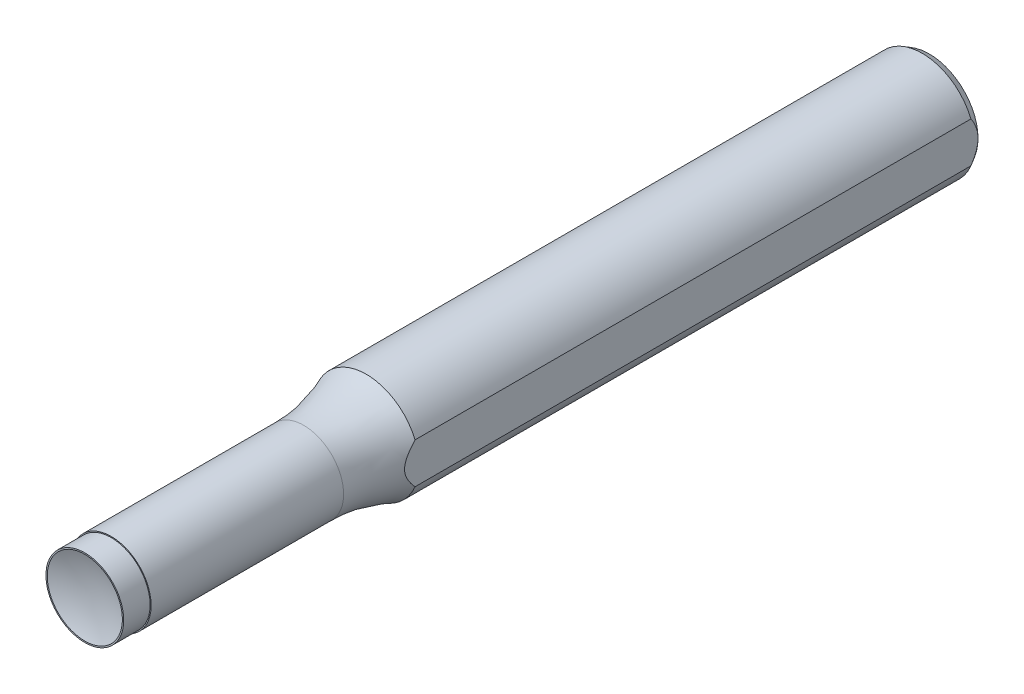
ISO-10303-21;
HEADER;
FILE_DESCRIPTION(('STEP AP214'),'2;1');
FILE_NAME('part.step','',(''),(''),'','','');
FILE_SCHEMA(('AUTOMOTIVE_DESIGN { 1 0 10303 214 1 1 1 1 }'));
ENDSEC;
DATA;
#1=APPLICATION_CONTEXT('core data for automotive mechanical design processes');
#2=APPLICATION_PROTOCOL_DEFINITION('international standard','automotive_design',2000,#1);
#3=PRODUCT_CONTEXT('',#1,'mechanical');
#4=PRODUCT('Part','Part','',(#3));
#5=PRODUCT_RELATED_PRODUCT_CATEGORY('part','',(#4));
#6=PRODUCT_DEFINITION_FORMATION('','',#4);
#7=PRODUCT_DEFINITION_CONTEXT('part definition',#1,'design');
#8=PRODUCT_DEFINITION('design','',#6,#7);
#9=PRODUCT_DEFINITION_SHAPE('','',#8);
#10=(LENGTH_UNIT() NAMED_UNIT(*) SI_UNIT(.MILLI.,.METRE.));
#11=(NAMED_UNIT(*) PLANE_ANGLE_UNIT() SI_UNIT($,.RADIAN.));
#12=(NAMED_UNIT(*) SI_UNIT($,.STERADIAN.) SOLID_ANGLE_UNIT());
#13=UNCERTAINTY_MEASURE_WITH_UNIT(LENGTH_MEASURE(1.E-05),#10,'distance_accuracy_value','');
#14=(GEOMETRIC_REPRESENTATION_CONTEXT(3) GLOBAL_UNCERTAINTY_ASSIGNED_CONTEXT((#13)) GLOBAL_UNIT_ASSIGNED_CONTEXT((#10,
#11,#12)) REPRESENTATION_CONTEXT('',''));
#15=CARTESIAN_POINT('',(0.,0.,0.));
#16=DIRECTION('',(0.,0.,1.));
#17=DIRECTION('',(1.,0.,0.));
#18=AXIS2_PLACEMENT_3D('',#15,#16,#17);
#19=CARTESIAN_POINT('',(0.,0.,-42.3333333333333));
#20=DIRECTION('',(0.,0.,1.));
#21=DIRECTION('',(1.,0.,0.));
#22=AXIS2_PLACEMENT_3D('',#19,#20,#21);
#23=CYLINDRICAL_SURFACE('',#22,6.);
#24=CARTESIAN_POINT('',(0.,0.,-32.9174956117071));
#25=DIRECTION('',(0.,0.,1.));
#26=DIRECTION('',(0.,-1.,0.));
#27=AXIS2_PLACEMENT_3D('',#24,#25,#26);
#28=CIRCLE('',#27,6.);
#29=CARTESIAN_POINT('',(0.,-6.,-32.9174956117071));
#30=VERTEX_POINT('',#29);
#31=EDGE_CURVE('E79',#30,#30,#28,.F.);
#32=ORIENTED_EDGE('',*,*,#31,.F.);
#33=EDGE_LOOP('',(#32));
#34=FACE_BOUND('',#33,.T.);
#35=CARTESIAN_POINT('',(0.,0.,-3.97));
#36=DIRECTION('',(0.,0.,1.));
#37=DIRECTION('',(1.,0.,0.));
#38=AXIS2_PLACEMENT_3D('',#35,#36,#37);
#39=CIRCLE('',#38,6.);
#40=CARTESIAN_POINT('',(6.,0.,-3.97));
#41=VERTEX_POINT('',#40);
#42=EDGE_CURVE('E90',#41,#41,#39,.F.);
#43=ORIENTED_EDGE('',*,*,#42,.T.);
#44=EDGE_LOOP('',(#43));
#45=FACE_BOUND('',#44,.T.);
#46=ADVANCED_FACE('F42',(#34,#45),#23,.T.);
#47=CARTESIAN_POINT('',(0.,0.,-3.97));
#48=DIRECTION('',(0.,0.,1.));
#49=DIRECTION('',(1.,0.,0.));
#50=AXIS2_PLACEMENT_3D('',#47,#48,#49);
#51=PLANE('',#50);
#52=ORIENTED_EDGE('',*,*,#42,.F.);
#53=EDGE_LOOP('',(#52));
#54=FACE_BOUND('',#53,.T.);
#55=CARTESIAN_POINT('',(0.,0.,-3.97));
#56=DIRECTION('',(0.,0.,1.));
#57=DIRECTION('',(1.,0.,0.));
#58=AXIS2_PLACEMENT_3D('',#55,#56,#57);
#59=CIRCLE('',#58,5.85);
#60=CARTESIAN_POINT('',(5.85,0.,-3.97));
#61=VERTEX_POINT('',#60);
#62=EDGE_CURVE('E97',#61,#61,#59,.T.);
#63=ORIENTED_EDGE('',*,*,#62,.F.);
#64=EDGE_LOOP('',(#63));
#65=FACE_BOUND('',#64,.T.);
#66=ADVANCED_FACE('F109',(#54,#65),#51,.T.);
#67=CARTESIAN_POINT('',(0.,0.,-3.97));
#68=DIRECTION('',(0.,0.,1.));
#69=DIRECTION('',(1.,0.,0.));
#70=AXIS2_PLACEMENT_3D('',#67,#68,#69);
#71=CYLINDRICAL_SURFACE('',#70,5.85);
#72=ORIENTED_EDGE('',*,*,#62,.T.);
#73=EDGE_LOOP('',(#72));
#74=FACE_BOUND('',#73,.T.);
#75=CARTESIAN_POINT('',(0.,0.,0.));
#76=DIRECTION('',(0.,0.,1.));
#77=DIRECTION('',(1.,0.,0.));
#78=AXIS2_PLACEMENT_3D('',#75,#76,#77);
#79=CIRCLE('',#78,5.85);
#80=CARTESIAN_POINT('',(5.85,0.,0.));
#81=VERTEX_POINT('',#80);
#82=EDGE_CURVE('E120',#81,#81,#79,.T.);
#83=ORIENTED_EDGE('',*,*,#82,.F.);
#84=EDGE_LOOP('',(#83));
#85=FACE_BOUND('',#84,.T.);
#86=ADVANCED_FACE('F115',(#74,#85),#71,.T.);
#87=CARTESIAN_POINT('',(0.,0.,0.));
#88=DIRECTION('',(0.,0.,1.));
#89=DIRECTION('',(1.,0.,0.));
#90=AXIS2_PLACEMENT_3D('',#87,#88,#89);
#91=PLANE('',#90);
#92=CARTESIAN_POINT('',(0.,0.,0.));
#93=DIRECTION('',(0.,0.,1.));
#94=DIRECTION('',(0.,-1.,0.));
#95=AXIS2_PLACEMENT_3D('',#92,#93,#94);
#96=CIRCLE('',#95,5.65);
#97=CARTESIAN_POINT('',(0.,-5.65,0.));
#98=VERTEX_POINT('',#97);
#99=EDGE_CURVE('E125',#98,#98,#96,.T.);
#100=ORIENTED_EDGE('',*,*,#99,.F.);
#101=EDGE_LOOP('',(#100));
#102=FACE_BOUND('',#101,.T.);
#103=ORIENTED_EDGE('',*,*,#82,.T.);
#104=EDGE_LOOP('',(#103));
#105=FACE_BOUND('',#104,.T.);
#106=ADVANCED_FACE('F156',(#102,#105),#91,.T.);
#107=CARTESIAN_POINT('',(0.,0.,14.8408860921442));
#108=DIRECTION('',(0.,0.,1.));
#109=DIRECTION('',(0.,-1.,0.));
#110=AXIS2_PLACEMENT_3D('',#107,#108,#109);
#111=SPHERICAL_SURFACE('',#110,15.88);
#112=ORIENTED_EDGE('',*,*,#99,.T.);
#113=EDGE_LOOP('',(#112));
#114=FACE_BOUND('',#113,.T.);
#115=ADVANCED_FACE('F159',(#114),#111,.F.);
#116=CARTESIAN_POINT('',(0.,0.,-32.9174956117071));
#117=DIRECTION('',(0.,0.,-1.));
#118=DIRECTION('',(0.,1.,0.));
#119=AXIS2_PLACEMENT_3D('',#116,#117,#118);
#120=TOROIDAL_SURFACE('',#119,29.82,23.82);
#121=CARTESIAN_POINT('',(7.32877851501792,14.2795877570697,-52.3543799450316));
#122=CARTESIAN_POINT('',(7.32877851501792,14.0393982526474,-52.203000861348));
#123=CARTESIAN_POINT('',(7.32877851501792,13.8012540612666,-52.0484082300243));
#124=CARTESIAN_POINT('',(7.32877851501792,13.3290852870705,-51.7330837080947));
#125=CARTESIAN_POINT('',(7.32877851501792,13.0950604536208,-51.5723521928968));
#126=CARTESIAN_POINT('',(7.32877851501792,12.3994624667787,-51.0815626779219));
#127=CARTESIAN_POINT('',(7.32877851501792,11.9440576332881,-50.7427147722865));
#128=CARTESIAN_POINT('',(7.32877851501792,11.0529688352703,-50.0467778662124));
#129=CARTESIAN_POINT('',(7.32877851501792,10.6171627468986,-49.6898444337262));
#130=CARTESIAN_POINT('',(7.32877851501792,9.76079496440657,-48.9580849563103));
#131=CARTESIAN_POINT('',(7.32877851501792,9.34023511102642,-48.5832567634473));
#132=CARTESIAN_POINT('',(7.32877851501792,8.51690474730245,-47.8225416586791));
#133=CARTESIAN_POINT('',(7.32877851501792,8.11400033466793,-47.4367990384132));
#134=CARTESIAN_POINT('',(7.32877851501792,7.51777550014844,-46.8499808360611));
#135=CARTESIAN_POINT('',(7.32877851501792,7.32038661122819,-46.6530047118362));
#136=CARTESIAN_POINT('',(7.32877851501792,6.9278267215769,-46.256853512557));
#137=CARTESIAN_POINT('',(7.32877851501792,6.73265572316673,-46.0576784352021));
#138=CARTESIAN_POINT('',(7.32877851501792,6.34374892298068,-45.6575555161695));
#139=CARTESIAN_POINT('',(7.32877851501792,6.15001472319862,-45.4566061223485));
#140=CARTESIAN_POINT('',(7.32877851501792,5.76339986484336,-45.0538895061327));
#141=CARTESIAN_POINT('',(7.32877851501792,5.57051920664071,-44.8521222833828));
#142=CARTESIAN_POINT('',(7.32877851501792,5.18461104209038,-44.4487600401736));
#143=CARTESIAN_POINT('',(7.32877851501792,4.99158354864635,-44.2471650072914));
#144=CARTESIAN_POINT('',(7.32877851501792,4.60401918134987,-43.8454334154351));
#145=CARTESIAN_POINT('',(7.32877851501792,4.40948236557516,-43.645296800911));
#146=CARTESIAN_POINT('',(7.32877851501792,4.14723954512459,-43.3800829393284));
#147=CARTESIAN_POINT('',(7.32877851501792,4.08104059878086,-43.3135182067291));
#148=CARTESIAN_POINT('',(7.32877851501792,3.94816187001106,-43.1808699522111));
#149=CARTESIAN_POINT('',(7.32877851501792,3.88148208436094,-43.114786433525));
#150=CARTESIAN_POINT('',(7.32877851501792,3.68058491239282,-42.9174220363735));
#151=CARTESIAN_POINT('',(7.32877851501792,3.54550041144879,-42.7870178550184));
#152=CARTESIAN_POINT('',(7.32877851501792,3.2717754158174,-42.5294069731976));
#153=CARTESIAN_POINT('',(7.32877851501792,3.13312816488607,-42.4022074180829));
#154=CARTESIAN_POINT('',(7.32877851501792,2.85130496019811,-42.1529095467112));
#155=CARTESIAN_POINT('',(7.32877851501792,2.7081296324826,-42.0308105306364));
#156=CARTESIAN_POINT('',(7.32877851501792,2.4543267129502,-41.825456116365));
#157=CARTESIAN_POINT('',(7.32877851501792,2.34510762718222,-41.7404691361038));
#158=CARTESIAN_POINT('',(7.32877851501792,2.1226083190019,-41.5760100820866));
#159=CARTESIAN_POINT('',(7.32877851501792,2.00932933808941,-41.4965363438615));
#160=CARTESIAN_POINT('',(7.32877851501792,1.77819762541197,-41.3452373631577));
#161=CARTESIAN_POINT('',(7.32877851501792,1.66035964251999,-41.2733898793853));
#162=CARTESIAN_POINT('',(7.32877851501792,1.41914925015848,-41.1397858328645));
#163=CARTESIAN_POINT('',(7.32877851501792,1.29578165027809,-41.0780207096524));
#164=CARTESIAN_POINT('',(7.32877851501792,1.02294248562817,-40.9592230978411));
#165=CARTESIAN_POINT('',(7.32877851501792,0.872434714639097,-40.9044961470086));
#166=CARTESIAN_POINT('',(7.32877851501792,0.56452978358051,-40.8196795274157));
#167=CARTESIAN_POINT('',(7.32877851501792,0.407145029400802,-40.7895472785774));
#168=CARTESIAN_POINT('',(7.32877851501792,0.168337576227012,-40.7663484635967));
#169=CARTESIAN_POINT('',(7.32877851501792,0.0878974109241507,-40.7623156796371));
#170=CARTESIAN_POINT('',(7.32877851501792,-0.0730050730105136,-40.7618471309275));
#171=CARTESIAN_POINT('',(7.32877851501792,-0.153467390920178,-40.7654111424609));
#172=CARTESIAN_POINT('',(7.32877851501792,-0.393758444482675,-40.7873691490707));
#173=CARTESIAN_POINT('',(7.32877851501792,-0.552631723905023,-40.8170158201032));
#174=CARTESIAN_POINT('',(7.32877851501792,-0.910509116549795,-40.9142233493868));
#175=CARTESIAN_POINT('',(7.32877851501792,-1.10702898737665,-40.9905708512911));
#176=CARTESIAN_POINT('',(7.32877851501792,-1.3915062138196,-41.1263804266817));
#177=CARTESIAN_POINT('',(7.32877851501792,-1.48486398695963,-41.1753672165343));
#178=CARTESIAN_POINT('',(7.32877851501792,-1.6683508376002,-41.2790446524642));
#179=CARTESIAN_POINT('',(7.32877851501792,-1.75848081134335,-41.3337336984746));
#180=CARTESIAN_POINT('',(7.32877851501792,-1.99971641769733,-41.4886159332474));
#181=CARTESIAN_POINT('',(7.32877851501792,-2.1479749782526,-41.5932086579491));
#182=CARTESIAN_POINT('',(7.32877851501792,-2.43781275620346,-41.8113372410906));
#183=CARTESIAN_POINT('',(7.32877851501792,-2.57938647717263,-41.9248802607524));
#184=CARTESIAN_POINT('',(7.32877851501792,-2.85777730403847,-42.1583629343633));
#185=CARTESIAN_POINT('',(7.32877851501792,-2.99458030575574,-42.278319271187));
#186=CARTESIAN_POINT('',(7.32877851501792,-3.26430845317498,-42.5223996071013));
#187=CARTESIAN_POINT('',(7.32877851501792,-3.39723479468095,-42.6465222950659));
#188=CARTESIAN_POINT('',(7.32877851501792,-3.66164073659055,-42.8989451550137));
#189=CARTESIAN_POINT('',(7.32877851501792,-3.79309190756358,-43.0272749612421));
#190=CARTESIAN_POINT('',(7.32877851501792,-4.05400852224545,-43.2859453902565));
#191=CARTESIAN_POINT('',(7.32877851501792,-4.18347384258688,-43.4162861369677));
#192=CARTESIAN_POINT('',(7.32877851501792,-4.44088800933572,-43.6780719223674));
#193=CARTESIAN_POINT('',(7.32877851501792,-4.56883882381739,-43.809515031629));
#194=CARTESIAN_POINT('',(7.32877851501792,-4.82394795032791,-44.0731620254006));
#195=CARTESIAN_POINT('',(7.32877851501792,-4.95110627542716,-44.205365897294));
#196=CARTESIAN_POINT('',(7.32877851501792,-5.25569316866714,-44.5228914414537));
#197=CARTESIAN_POINT('',(7.32877851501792,-5.43295145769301,-44.7083761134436));
#198=CARTESIAN_POINT('',(7.32877851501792,-5.78770408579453,-45.0791206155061));
#199=CARTESIAN_POINT('',(7.32877851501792,-5.96519842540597,-45.2643804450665));
#200=CARTESIAN_POINT('',(7.32877851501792,-6.32113567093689,-45.633988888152));
#201=CARTESIAN_POINT('',(7.32877851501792,-6.49957857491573,-45.8183375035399));
#202=CARTESIAN_POINT('',(7.32877851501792,-6.85796743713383,-46.1855669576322));
#203=CARTESIAN_POINT('',(7.32877851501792,-7.03791339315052,-46.3684477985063));
#204=CARTESIAN_POINT('',(7.32877851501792,-7.58055333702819,-46.9140266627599));
#205=CARTESIAN_POINT('',(7.32877851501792,-7.94619559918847,-47.2738144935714));
#206=CARTESIAN_POINT('',(7.32877851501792,-8.68790577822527,-47.9825415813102));
#207=CARTESIAN_POINT('',(7.32877851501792,-9.06397393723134,-48.3314805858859));
#208=CARTESIAN_POINT('',(7.32877851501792,-9.82269119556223,-49.0111363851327));
#209=CARTESIAN_POINT('',(7.32877851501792,-10.2051709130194,-49.3420416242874));
#210=CARTESIAN_POINT('',(7.32877851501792,-10.982677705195,-49.988722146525));
#211=CARTESIAN_POINT('',(7.32877851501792,-11.3777035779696,-50.3044988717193));
#212=CARTESIAN_POINT('',(7.32877851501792,-12.182703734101,-50.9205051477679));
#213=CARTESIAN_POINT('',(7.32877851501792,-12.5927396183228,-51.220654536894));
#214=CARTESIAN_POINT('',(7.32877851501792,-13.2177751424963,-51.6567016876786));
#215=CARTESIAN_POINT('',(7.32877851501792,-13.4278332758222,-51.7997191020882));
#216=CARTESIAN_POINT('',(7.32877851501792,-13.8512445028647,-52.0808093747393));
#217=CARTESIAN_POINT('',(7.32877851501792,-14.0645977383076,-52.2188820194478));
#218=CARTESIAN_POINT('',(7.32877851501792,-14.2795877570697,-52.3543799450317));
#219=B_SPLINE_CURVE_WITH_KNOTS('',3,(#121,#122,#123,#124,#125,#126,#127,#128,#129,#130,#131,
#132,#133,#134,#135,#136,#137,#138,#139,#140,#141,#142,#143,#144,#145,#146,#147,#148,#149,#150,
#151,#152,#153,#154,#155,#156,#157,#158,#159,#160,#161,#162,#163,#164,#165,#166,#167,#168,#169,
#170,#171,#172,#173,#174,#175,#176,#177,#178,#179,#180,#181,#182,#183,#184,#185,#186,#187,#188,
#189,#190,#191,#192,#193,#194,#195,#196,#197,#198,#199,#200,#201,#202,#203,#204,#205,#206,#207,
#208,#209,#210,#211,#212,#213,#214,#215,#216,#217,#218),.UNSPECIFIED.,.F.,.F.,(4,2,2,2,2,2,2,2,
2,2,2,2,2,2,2,2,2,2,2,2,2,2,2,2,2,2,2,2,2,2,2,2,2,2,2,2,2,2,2,2,2,2,2,2,2,2,2,2,4),(0.,
0.851683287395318,1.70331457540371,3.40548445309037,5.09490998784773,6.7845388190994,
8.45761684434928,9.29417814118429,10.1307403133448,10.9681260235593,11.805512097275,
12.6428315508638,13.4801189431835,13.7617519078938,14.04338676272,14.6066166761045,
15.1710076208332,15.7353208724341,16.1503628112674,16.5652788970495,16.9789495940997,
17.3922672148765,17.8711591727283,18.3492202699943,18.5905181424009,18.8318089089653,
19.3139742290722,19.9427313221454,20.2589021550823,20.5749845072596,21.1187662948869,
21.6629876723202,22.2087010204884,22.7542442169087,23.3053313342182,23.8564525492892,
24.4067545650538,24.9570474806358,25.7267391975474,26.4964326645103,27.2661245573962,
28.0358153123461,29.5745610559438,31.1133425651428,32.630264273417,34.147041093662,
35.6709561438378,36.4332635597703,37.1956038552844),.UNSPECIFIED.);
#220=CARTESIAN_POINT('',(7.32877851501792,3.05493133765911,-42.3333333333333));
#221=VERTEX_POINT('',#220);
#222=CARTESIAN_POINT('',(7.32877851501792,-3.05493133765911,-42.3333333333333));
#223=VERTEX_POINT('',#222);
#224=EDGE_CURVE('E58',#221,#223,#219,.T.);
#225=ORIENTED_EDGE('',*,*,#224,.F.);
#226=CARTESIAN_POINT('',(0.,0.,-42.3333333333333));
#227=DIRECTION('',(0.,0.,-1.));
#228=DIRECTION('',(0.,1.,0.));
#229=AXIS2_PLACEMENT_3D('',#226,#227,#228);
#230=CIRCLE('',#229,7.94);
#231=EDGE_CURVE('E129',#223,#221,#230,.T.);
#232=ORIENTED_EDGE('',*,*,#231,.F.);
#233=EDGE_LOOP('',(#225,#232));
#234=FACE_BOUND('',#233,.T.);
#235=ORIENTED_EDGE('',*,*,#31,.T.);
#236=EDGE_LOOP('',(#235));
#237=FACE_BOUND('',#236,.T.);
#238=ADVANCED_FACE('F105',(#234,#237),#120,.F.);
#239=CARTESIAN_POINT('',(0.,0.,-127.));
#240=DIRECTION('',(0.,0.,1.));
#241=DIRECTION('',(1.,0.,0.));
#242=AXIS2_PLACEMENT_3D('',#239,#240,#241);
#243=PLANE('',#242);
#244=CARTESIAN_POINT('',(0.,0.,-127.));
#245=DIRECTION('',(0.,0.,1.));
#246=DIRECTION('',(1.,0.,0.));
#247=AXIS2_PLACEMENT_3D('',#244,#245,#246);
#248=CIRCLE('',#247,7.32877851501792);
#249=CARTESIAN_POINT('',(7.32877851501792,0.,-127.));
#250=VERTEX_POINT('',#249);
#251=EDGE_CURVE('E85',#250,#250,#248,.F.);
#252=ORIENTED_EDGE('',*,*,#251,.T.);
#253=EDGE_LOOP('',(#252));
#254=FACE_BOUND('',#253,.T.);
#255=ADVANCED_FACE('F154',(#254),#243,.F.);
#256=CARTESIAN_POINT('',(0.,0.,-125.941333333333));
#257=DIRECTION('',(0.,0.,1.));
#258=DIRECTION('',(1.,0.,0.));
#259=AXIS2_PLACEMENT_3D('',#256,#257,#258);
#260=CONICAL_SURFACE('',#259,7.94,0.523598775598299);
#261=CARTESIAN_POINT('',(7.32877851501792,-8.88843113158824,-119.740230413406));
#262=CARTESIAN_POINT('',(7.32877851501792,-8.73080406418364,-119.950851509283));
#263=CARTESIAN_POINT('',(7.32877851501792,-8.57211012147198,-120.160681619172));
#264=CARTESIAN_POINT('',(7.32877851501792,-8.2522191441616,-120.578457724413));
#265=CARTESIAN_POINT('',(7.32877851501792,-8.09102185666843,-120.786403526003));
#266=CARTESIAN_POINT('',(7.32877851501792,-7.76533800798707,-121.200636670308));
#267=CARTESIAN_POINT('',(7.32877851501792,-7.60084359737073,-121.406917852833));
#268=CARTESIAN_POINT('',(7.32877851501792,-7.26855482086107,-121.816797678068));
#269=CARTESIAN_POINT('',(7.32877851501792,-7.10076056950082,-122.020396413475));
#270=CARTESIAN_POINT('',(7.32877851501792,-6.75953587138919,-122.426496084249));
#271=CARTESIAN_POINT('',(7.32877851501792,-6.5860646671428,-122.628962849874));
#272=CARTESIAN_POINT('',(7.32877851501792,-6.2345106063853,-123.029849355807));
#273=CARTESIAN_POINT('',(7.32877851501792,-6.05642794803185,-123.228269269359));
#274=CARTESIAN_POINT('',(7.32877851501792,-5.69497835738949,-123.619871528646));
#275=CARTESIAN_POINT('',(7.32877851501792,-5.51161708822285,-123.813059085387));
#276=CARTESIAN_POINT('',(7.32877851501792,-5.13840554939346,-124.193037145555));
#277=CARTESIAN_POINT('',(7.32877851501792,-4.94855643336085,-124.379828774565));
#278=CARTESIAN_POINT('',(7.32877851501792,-4.6185619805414,-124.690909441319));
#279=CARTESIAN_POINT('',(7.32877851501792,-4.48039232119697,-124.817291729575));
#280=CARTESIAN_POINT('',(7.32877851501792,-4.19962787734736,-125.065084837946));
#281=CARTESIAN_POINT('',(7.32877851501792,-4.05703278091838,-125.186495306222));
#282=CARTESIAN_POINT('',(7.32877851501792,-3.76656482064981,-125.423404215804));
#283=CARTESIAN_POINT('',(7.32877851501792,-3.6186830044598,-125.538891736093));
#284=CARTESIAN_POINT('',(7.32877851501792,-3.31722208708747,-125.762227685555));
#285=CARTESIAN_POINT('',(7.32877851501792,-3.16364295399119,-125.870076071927));
#286=CARTESIAN_POINT('',(7.32877851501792,-2.8476171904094,-126.077847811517));
#287=CARTESIAN_POINT('',(7.32877851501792,-2.68506781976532,-126.177616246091));
#288=CARTESIAN_POINT('',(7.32877851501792,-2.3528177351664,-126.364667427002));
#289=CARTESIAN_POINT('',(7.32877851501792,-2.18311574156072,-126.451947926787));
#290=CARTESIAN_POINT('',(7.32877851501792,-1.83724775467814,-126.610376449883));
#291=CARTESIAN_POINT('',(7.32877851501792,-1.66111710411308,-126.681600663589));
#292=CARTESIAN_POINT('',(7.32877851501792,-1.3022419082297,-126.804750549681));
#293=CARTESIAN_POINT('',(7.32877851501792,-1.11950321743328,-126.856692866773));
#294=CARTESIAN_POINT('',(7.32877851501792,-0.813030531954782,-126.923831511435));
#295=CARTESIAN_POINT('',(7.32877851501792,-0.690702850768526,-126.945522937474));
#296=CARTESIAN_POINT('',(7.32877851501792,-0.444657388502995,-126.978429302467));
#297=CARTESIAN_POINT('',(7.32877851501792,-0.320940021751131,-126.989647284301));
#298=CARTESIAN_POINT('',(7.32877851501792,-0.073012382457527,-127.001184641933));
#299=CARTESIAN_POINT('',(7.32877851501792,0.0511978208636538,-127.001505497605));
#300=CARTESIAN_POINT('',(7.32877851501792,0.299168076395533,-126.991242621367));
#301=CARTESIAN_POINT('',(7.32877851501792,0.422928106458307,-126.980658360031));
#302=CARTESIAN_POINT('',(7.32877851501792,0.668575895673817,-126.949047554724));
#303=CARTESIAN_POINT('',(7.32877851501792,0.790469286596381,-126.928064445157));
#304=CARTESIAN_POINT('',(7.32877851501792,1.03220206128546,-126.876404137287));
#305=CARTESIAN_POINT('',(7.32877851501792,1.15204057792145,-126.845722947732));
#306=CARTESIAN_POINT('',(7.32877851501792,1.50769171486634,-126.740480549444));
#307=CARTESIAN_POINT('',(7.32877851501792,1.73965666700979,-126.652718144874));
#308=CARTESIAN_POINT('',(7.32877851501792,2.17012243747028,-126.45964290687));
#309=CARTESIAN_POINT('',(7.32877851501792,2.36973261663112,-126.356709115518));
#310=CARTESIAN_POINT('',(7.32877851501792,2.75934848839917,-126.133817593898));
#311=CARTESIAN_POINT('',(7.32877851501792,2.9493454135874,-126.0138446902));
#312=CARTESIAN_POINT('',(7.32877851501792,3.32222206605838,-125.759850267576));
#313=CARTESIAN_POINT('',(7.32877851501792,3.50501774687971,-125.625706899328));
#314=CARTESIAN_POINT('',(7.32877851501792,3.86268505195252,-125.347474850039));
#315=CARTESIAN_POINT('',(7.32877851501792,4.03755997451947,-125.203390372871));
#316=CARTESIAN_POINT('',(7.32877851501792,4.43901655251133,-124.857102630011));
#317=CARTESIAN_POINT('',(7.32877851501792,4.66292739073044,-124.65181624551));
#318=CARTESIAN_POINT('',(7.32877851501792,5.10105623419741,-124.231095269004));
#319=CARTESIAN_POINT('',(7.32877851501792,5.31527068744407,-124.015657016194));
#320=CARTESIAN_POINT('',(7.32877851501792,5.73618445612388,-123.576758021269));
#321=CARTESIAN_POINT('',(7.32877851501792,5.94286768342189,-123.353281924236));
#322=CARTESIAN_POINT('',(7.32877851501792,6.34971215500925,-122.90046420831));
#323=CARTESIAN_POINT('',(7.32877851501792,6.54987289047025,-122.671122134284));
#324=CARTESIAN_POINT('',(7.32877851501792,6.93408307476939,-122.220381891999));
#325=CARTESIAN_POINT('',(7.32877851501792,7.11841797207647,-121.999226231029));
#326=CARTESIAN_POINT('',(7.32877851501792,7.48300213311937,-121.553559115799));
#327=CARTESIAN_POINT('',(7.32877851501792,7.66325117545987,-121.329047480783));
#328=CARTESIAN_POINT('',(7.32877851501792,8.01935572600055,-120.878424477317));
#329=CARTESIAN_POINT('',(7.32877851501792,8.1952289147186,-120.652327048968));
#330=CARTESIAN_POINT('',(7.32877851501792,8.54396458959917,-120.197873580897));
#331=CARTESIAN_POINT('',(7.32877851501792,8.71682751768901,-119.969517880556));
#332=CARTESIAN_POINT('',(7.32877851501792,8.88843113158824,-119.740230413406));
#333=B_SPLINE_CURVE_WITH_KNOTS('',3,(#261,#262,#263,#264,#265,#266,#267,#268,#269,#270,#271,
#272,#273,#274,#275,#276,#277,#278,#279,#280,#281,#282,#283,#284,#285,#286,#287,#288,#289,#290,
#291,#292,#293,#294,#295,#296,#297,#298,#299,#300,#301,#302,#303,#304,#305,#306,#307,#308,#309,
#310,#311,#312,#313,#314,#315,#316,#317,#318,#319,#320,#321,#322,#323,#324,#325,#326,#327,#328,
#329,#330,#331,#332),.UNSPECIFIED.,.F.,.F.,(4,2,2,2,2,2,2,2,2,2,2,2,2,2,2,2,2,2,2,2,2,2,2,2,2,2,
2,2,2,2,2,2,2,2,2,4),(0.,0.789225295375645,1.57853084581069,2.37001454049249,3.16147081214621,
3.96126621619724,4.76102730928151,5.55996020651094,6.35875177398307,6.92041249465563,
7.48211289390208,8.04481426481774,8.60751878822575,9.17925174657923,9.75108742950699,
10.3201496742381,10.8887195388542,11.2610272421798,11.6332267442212,12.0053756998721,
12.3775427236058,12.7481682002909,13.118946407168,13.8604526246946,14.5332661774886,
15.2066826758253,15.8864517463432,16.5659350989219,17.4768018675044,18.3879996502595,
19.3010416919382,20.2141547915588,21.0778126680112,21.9415172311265,22.8008298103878,
23.6600151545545),.UNSPECIFIED.);
#334=CARTESIAN_POINT('',(7.32877851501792,-3.05493133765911,-125.941333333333));
#335=VERTEX_POINT('',#334);
#336=EDGE_CURVE('E73',#335,#250,#333,.T.);
#337=ORIENTED_EDGE('',*,*,#336,.F.);
#338=CARTESIAN_POINT('',(0.,0.,-125.941333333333));
#339=DIRECTION('',(0.,0.,1.));
#340=DIRECTION('',(1.,0.,0.));
#341=AXIS2_PLACEMENT_3D('',#338,#339,#340);
#342=CIRCLE('',#341,7.94);
#343=CARTESIAN_POINT('',(7.32877851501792,3.05493133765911,-125.941333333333));
#344=VERTEX_POINT('',#343);
#345=EDGE_CURVE('E83',#344,#335,#342,.T.);
#346=ORIENTED_EDGE('',*,*,#345,.F.);
#347=EDGE_CURVE('E64',#250,#344,#333,.T.);
#348=ORIENTED_EDGE('',*,*,#347,.F.);
#349=ORIENTED_EDGE('',*,*,#251,.F.);
#350=EDGE_LOOP('',(#337,#346,#348,#349));
#351=FACE_BOUND('',#350,.T.);
#352=ADVANCED_FACE('F44',(#351),#260,.T.);
#353=CARTESIAN_POINT('',(0.,0.,-127.));
#354=DIRECTION('',(0.,0.,1.));
#355=DIRECTION('',(1.,0.,0.));
#356=AXIS2_PLACEMENT_3D('',#353,#354,#355);
#357=CYLINDRICAL_SURFACE('',#356,7.94);
#358=DIRECTION('',(0.,0.,1.));
#359=VECTOR('',#358,1.);
#360=CARTESIAN_POINT('',(7.32877851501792,3.05493133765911,-127.));
#361=LINE('',#360,#359);
#362=EDGE_CURVE('E13',#344,#221,#361,.T.);
#363=ORIENTED_EDGE('',*,*,#362,.F.);
#364=ORIENTED_EDGE('',*,*,#345,.T.);
#365=DIRECTION('',(0.,0.,1.));
#366=VECTOR('',#365,1.);
#367=CARTESIAN_POINT('',(7.32877851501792,-3.05493133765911,-127.));
#368=LINE('',#367,#366);
#369=EDGE_CURVE('E52',#223,#335,#368,.F.);
#370=ORIENTED_EDGE('',*,*,#369,.F.);
#371=ORIENTED_EDGE('',*,*,#231,.T.);
#372=EDGE_LOOP('',(#363,#364,#370,#371));
#373=FACE_BOUND('',#372,.T.);
#374=ADVANCED_FACE('F88',(#373),#357,.T.);
#375=CARTESIAN_POINT('',(7.32877851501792,3.05493133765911,0.));
#376=DIRECTION('',(-1.,0.,0.));
#377=DIRECTION('',(0.,0.,1.));
#378=AXIS2_PLACEMENT_3D('',#375,#376,#377);
#379=PLANE('',#378);
#380=ORIENTED_EDGE('',*,*,#224,.T.);
#381=ORIENTED_EDGE('',*,*,#369,.T.);
#382=ORIENTED_EDGE('',*,*,#336,.T.);
#383=ORIENTED_EDGE('',*,*,#347,.T.);
#384=ORIENTED_EDGE('',*,*,#362,.T.);
#385=EDGE_LOOP('',(#380,#381,#382,#383,#384));
#386=FACE_BOUND('',#385,.T.);
#387=ADVANCED_FACE('F72',(#386),#379,.F.);
#388=CLOSED_SHELL('',(#46,#66,#86,#106,#115,#238,#255,#352,#374,#387));
#389=MANIFOLD_SOLID_BREP('B2',#388);
#390=ADVANCED_BREP_SHAPE_REPRESENTATION('',(#18,#389),#14);
#391=SHAPE_DEFINITION_REPRESENTATION(#9,#390);
ENDSEC;
END-ISO-10303-21;
